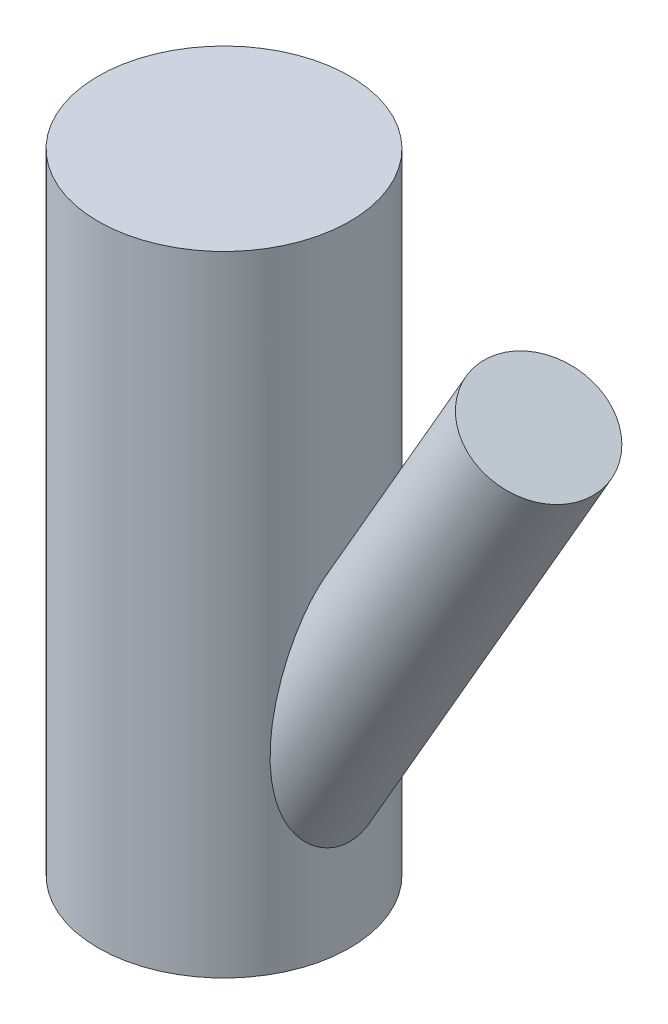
from build123d import *

# Parameters (mm, degrees)
SKETCH3_R      = 10
EXTRUDE1_DEPTH = 50


with BuildPart() as part:
    # Sketch3 → Extrude1 (new body)
    with BuildSketch(Plane(origin=(0, 0, 0), x_dir=(1, 0, 0), z_dir=(0, 1, 0))):
        with Locations(Location((0, 0, 0), (0, 0, 270))):
            Circle(SKETCH3_R)
    extrude(amount=EXTRUDE1_DEPTH)

    # Sketch2 → Revolve1 (revolve)
    with BuildSketch(Plane.XY, mode=Mode.PRIVATE) as revolve1_sk:
        Polygon((25, 43.301270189), (20.669872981, 45.801270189), (0.669872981, 11.160254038), (5, 8.660254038), align=None)
    revolve(revolve1_sk.sketch.rotate(Axis((0, 0, 0), (0.4999999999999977, 0.86602540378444, 0)), 180), axis=Axis((0, 0, 0), (0.4999999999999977, 0.86602540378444, 0)))


solid = part.part
